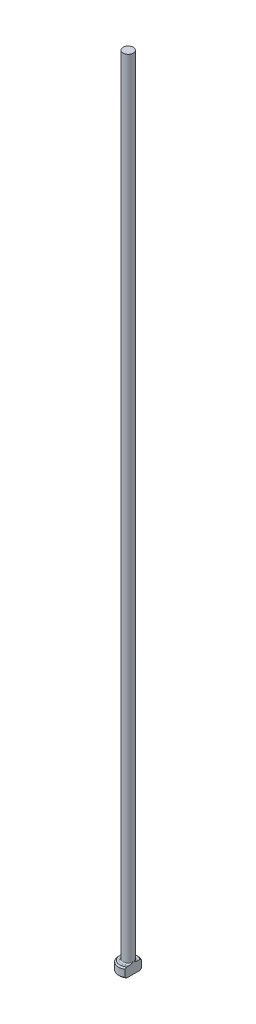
ISO-10303-21;
HEADER;
FILE_DESCRIPTION(('STEP AP214'),'2;1');
FILE_NAME('part.step','',(''),(''),'','','');
FILE_SCHEMA(('AUTOMOTIVE_DESIGN { 1 0 10303 214 1 1 1 1 }'));
ENDSEC;
DATA;
#1=APPLICATION_CONTEXT('core data for automotive mechanical design processes');
#2=APPLICATION_PROTOCOL_DEFINITION('international standard','automotive_design',2000,#1);
#3=PRODUCT_CONTEXT('',#1,'mechanical');
#4=PRODUCT('Part','Part','',(#3));
#5=PRODUCT_RELATED_PRODUCT_CATEGORY('part','',(#4));
#6=PRODUCT_DEFINITION_FORMATION('','',#4);
#7=PRODUCT_DEFINITION_CONTEXT('part definition',#1,'design');
#8=PRODUCT_DEFINITION('design','',#6,#7);
#9=PRODUCT_DEFINITION_SHAPE('','',#8);
#10=(LENGTH_UNIT() NAMED_UNIT(*) SI_UNIT(.MILLI.,.METRE.));
#11=(NAMED_UNIT(*) PLANE_ANGLE_UNIT() SI_UNIT($,.RADIAN.));
#12=(NAMED_UNIT(*) SI_UNIT($,.STERADIAN.) SOLID_ANGLE_UNIT());
#13=UNCERTAINTY_MEASURE_WITH_UNIT(LENGTH_MEASURE(1.E-05),#10,'distance_accuracy_value','');
#14=(GEOMETRIC_REPRESENTATION_CONTEXT(3) GLOBAL_UNCERTAINTY_ASSIGNED_CONTEXT((#13)) GLOBAL_UNIT_ASSIGNED_CONTEXT((#10,
#11,#12)) REPRESENTATION_CONTEXT('',''));
#15=CARTESIAN_POINT('',(0.,0.,0.));
#16=DIRECTION('',(0.,0.,1.));
#17=DIRECTION('',(1.,0.,0.));
#18=AXIS2_PLACEMENT_3D('',#15,#16,#17);
#19=CARTESIAN_POINT('',(0.,0.,0.));
#20=DIRECTION('',(0.,-1.,0.));
#21=DIRECTION('',(0.,0.,-1.));
#22=AXIS2_PLACEMENT_3D('',#19,#20,#21);
#23=PLANE('',#22);
#24=CARTESIAN_POINT('',(0.,0.,0.));
#25=DIRECTION('',(0.,-1.,0.));
#26=DIRECTION('',(0.,0.,-1.));
#27=AXIS2_PLACEMENT_3D('',#24,#25,#26);
#28=CIRCLE('',#27,1.29999999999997);
#29=CARTESIAN_POINT('',(0.799999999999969,0.,1.02469507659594));
#30=VERTEX_POINT('',#29);
#31=CARTESIAN_POINT('',(0.799999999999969,0.,-1.02469507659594));
#32=VERTEX_POINT('',#31);
#33=EDGE_CURVE('E98',#30,#32,#28,.T.);
#34=ORIENTED_EDGE('',*,*,#33,.T.);
#35=DIRECTION('',(0.,0.,1.));
#36=VECTOR('',#35,1.);
#37=CARTESIAN_POINT('',(0.799999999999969,0.,-1.26885775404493));
#38=LINE('',#37,#36);
#39=EDGE_CURVE('E83',#32,#30,#38,.T.);
#40=ORIENTED_EDGE('',*,*,#39,.T.);
#41=EDGE_LOOP('',(#34,#40));
#42=FACE_BOUND('',#41,.T.);
#43=ADVANCED_FACE('F32',(#42),#23,.T.);
#44=CARTESIAN_POINT('',(0.,259.958771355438,0.));
#45=DIRECTION('',(0.,1.,0.));
#46=DIRECTION('',(0.,0.,1.));
#47=AXIS2_PLACEMENT_3D('',#44,#45,#46);
#48=CYLINDRICAL_SURFACE('',#47,1.49999999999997);
#49=CARTESIAN_POINT('',(0.,1.29999999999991,0.));
#50=DIRECTION('',(0.,1.,0.));
#51=DIRECTION('',(0.,0.,1.));
#52=AXIS2_PLACEMENT_3D('',#49,#50,#51);
#53=CIRCLE('',#52,1.49999999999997);
#54=CARTESIAN_POINT('',(0.799999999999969,1.29999999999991,1.26885775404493));
#55=VERTEX_POINT('',#54);
#56=CARTESIAN_POINT('',(0.799999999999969,1.29999999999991,-1.26885775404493));
#57=VERTEX_POINT('',#56);
#58=EDGE_CURVE('E104',#55,#57,#53,.F.);
#59=ORIENTED_EDGE('',*,*,#58,.T.);
#60=DIRECTION('',(0.,-1.,0.));
#61=VECTOR('',#60,1.);
#62=CARTESIAN_POINT('',(0.799999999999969,125.,-1.26885775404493));
#63=LINE('',#62,#61);
#64=CARTESIAN_POINT('',(0.799999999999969,0.200000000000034,-1.26885775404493));
#65=VERTEX_POINT('',#64);
#66=EDGE_CURVE('E183',#57,#65,#63,.T.);
#67=ORIENTED_EDGE('',*,*,#66,.T.);
#68=CARTESIAN_POINT('',(0.,0.200000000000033,0.));
#69=DIRECTION('',(0.,-1.,0.));
#70=DIRECTION('',(0.,0.,-1.));
#71=AXIS2_PLACEMENT_3D('',#68,#69,#70);
#72=CIRCLE('',#71,1.49999999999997);
#73=CARTESIAN_POINT('',(0.799999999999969,0.200000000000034,1.26885775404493));
#74=VERTEX_POINT('',#73);
#75=EDGE_CURVE('E100',#65,#74,#72,.F.);
#76=ORIENTED_EDGE('',*,*,#75,.T.);
#77=DIRECTION('',(0.,-1.,0.));
#78=VECTOR('',#77,1.);
#79=CARTESIAN_POINT('',(0.799999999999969,125.,1.26885775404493));
#80=LINE('',#79,#78);
#81=EDGE_CURVE('E93',#55,#74,#80,.T.);
#82=ORIENTED_EDGE('',*,*,#81,.F.);
#83=EDGE_LOOP('',(#59,#67,#76,#82));
#84=FACE_BOUND('',#83,.T.);
#85=ADVANCED_FACE('F158',(#84),#48,.T.);
#86=CARTESIAN_POINT('',(-1.49999999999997,1.5,0.));
#87=DIRECTION('',(0.,1.,0.));
#88=DIRECTION('',(0.,0.,1.));
#89=AXIS2_PLACEMENT_3D('',#86,#87,#88);
#90=PLANE('',#89);
#91=CARTESIAN_POINT('',(0.,1.5,0.));
#92=DIRECTION('',(0.,1.,0.));
#93=DIRECTION('',(0.,0.,1.));
#94=AXIS2_PLACEMENT_3D('',#91,#92,#93);
#95=CIRCLE('',#94,1.29999999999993);
#96=CARTESIAN_POINT('',(0.799999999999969,1.5,-1.02469507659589));
#97=VERTEX_POINT('',#96);
#98=CARTESIAN_POINT('',(0.799999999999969,1.5,1.02469507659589));
#99=VERTEX_POINT('',#98);
#100=EDGE_CURVE('E178',#97,#99,#95,.T.);
#101=ORIENTED_EDGE('',*,*,#100,.T.);
#102=DIRECTION('',(0.,0.,-1.));
#103=VECTOR('',#102,1.);
#104=CARTESIAN_POINT('',(0.799999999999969,1.5,0.));
#105=LINE('',#104,#103);
#106=CARTESIAN_POINT('',(0.799999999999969,1.49999999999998,0.599999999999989));
#107=VERTEX_POINT('',#106);
#108=EDGE_CURVE('E57',#99,#107,#105,.T.);
#109=ORIENTED_EDGE('',*,*,#108,.T.);
#110=CARTESIAN_POINT('',(0.,1.5,0.));
#111=DIRECTION('',(0.,1.,0.));
#112=DIRECTION('',(0.,0.,1.));
#113=AXIS2_PLACEMENT_3D('',#110,#111,#112);
#114=CIRCLE('',#113,0.999999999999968);
#115=CARTESIAN_POINT('',(0.799999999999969,1.49999999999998,-0.600000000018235));
#116=VERTEX_POINT('',#115);
#117=EDGE_CURVE('E107',#107,#116,#114,.F.);
#118=ORIENTED_EDGE('',*,*,#117,.T.);
#119=EDGE_CURVE('E136',#116,#97,#105,.T.);
#120=ORIENTED_EDGE('',*,*,#119,.T.);
#121=EDGE_LOOP('',(#101,#109,#118,#120));
#122=FACE_BOUND('',#121,.T.);
#123=ADVANCED_FACE('F147',(#122),#90,.T.);
#124=CARTESIAN_POINT('',(0.,1.5,0.));
#125=DIRECTION('',(0.,-1.,0.));
#126=DIRECTION('',(0.,0.,-1.));
#127=AXIS2_PLACEMENT_3D('',#124,#125,#126);
#128=CONICAL_SURFACE('',#127,1.29999999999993,0.785398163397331);
#129=ORIENTED_EDGE('',*,*,#58,.F.);
#130=CARTESIAN_POINT('',(0.799999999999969,-0.108590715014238,2.79640840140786));
#131=CARTESIAN_POINT('',(0.799999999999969,-0.000882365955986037,2.68432462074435));
#132=CARTESIAN_POINT('',(0.799999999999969,0.106624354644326,2.57204275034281));
#133=CARTESIAN_POINT('',(0.799999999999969,0.320918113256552,2.34672914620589));
#134=CARTESIAN_POINT('',(0.799999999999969,0.427704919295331,2.23369719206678));
#135=CARTESIAN_POINT('',(0.799999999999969,0.639300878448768,2.00753337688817));
#136=CARTESIAN_POINT('',(0.799999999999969,0.744119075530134,1.89441000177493));
#137=CARTESIAN_POINT('',(0.799999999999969,0.951972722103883,1.66655886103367));
#138=CARTESIAN_POINT('',(0.799999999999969,1.05500843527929,1.55183133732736));
#139=CARTESIAN_POINT('',(0.799999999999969,1.2316116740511,1.34966755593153));
#140=CARTESIAN_POINT('',(0.799999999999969,1.30589617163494,1.26286366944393));
#141=CARTESIAN_POINT('',(0.799999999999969,1.41524859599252,1.13055151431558));
#142=CARTESIAN_POINT('',(0.799999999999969,1.45144464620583,1.08597829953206));
#143=CARTESIAN_POINT('',(0.799999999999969,1.52278909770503,0.996003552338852));
#144=CARTESIAN_POINT('',(0.799999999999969,1.55793758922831,0.950602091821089));
#145=CARTESIAN_POINT('',(0.799999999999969,1.6270756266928,0.858309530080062));
#146=CARTESIAN_POINT('',(0.799999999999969,1.66105269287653,0.811409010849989));
#147=CARTESIAN_POINT('',(0.799999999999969,1.7268909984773,0.71607032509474));
#148=CARTESIAN_POINT('',(0.799999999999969,1.75875040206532,0.667630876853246));
#149=CARTESIAN_POINT('',(0.799999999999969,1.81908230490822,0.568961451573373));
#150=CARTESIAN_POINT('',(0.799999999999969,1.84757011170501,0.518741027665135));
#151=CARTESIAN_POINT('',(0.799999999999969,1.89949059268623,0.415809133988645));
#152=CARTESIAN_POINT('',(0.799999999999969,1.92293317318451,0.363102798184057));
#153=CARTESIAN_POINT('',(0.799999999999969,1.96197481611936,0.254586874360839));
#154=CARTESIAN_POINT('',(0.799999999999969,1.97756580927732,0.198774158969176));
#155=CARTESIAN_POINT('',(0.799999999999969,1.99243400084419,0.113761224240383));
#156=CARTESIAN_POINT('',(0.799999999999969,1.99597240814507,0.0852975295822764));
#157=CARTESIAN_POINT('',(0.799999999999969,2.00001065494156,0.0281499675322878));
#158=CARTESIAN_POINT('',(0.799999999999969,2.00051084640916,-0.000533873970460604));
#159=CARTESIAN_POINT('',(0.799999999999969,1.99842510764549,-0.057827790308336));
#160=CARTESIAN_POINT('',(0.799999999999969,1.99583465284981,-0.0864376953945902));
#161=CARTESIAN_POINT('',(0.799999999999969,1.9877631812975,-0.143248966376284));
#162=CARTESIAN_POINT('',(0.799999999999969,1.98228105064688,-0.171450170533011));
#163=CARTESIAN_POINT('',(0.799999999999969,1.96874374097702,-0.227447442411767));
#164=CARTESIAN_POINT('',(0.799999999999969,1.96066903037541,-0.25523870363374));
#165=CARTESIAN_POINT('',(0.799999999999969,1.94239006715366,-0.310100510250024));
#166=CARTESIAN_POINT('',(0.799999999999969,1.93218575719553,-0.337171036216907));
#167=CARTESIAN_POINT('',(0.799999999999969,1.89406620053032,-0.429279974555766));
#168=CARTESIAN_POINT('',(0.799999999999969,1.86189848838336,-0.492545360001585));
#169=CARTESIAN_POINT('',(0.799999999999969,1.79172992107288,-0.615769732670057));
#170=CARTESIAN_POINT('',(0.799999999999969,1.75371426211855,-0.675719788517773));
#171=CARTESIAN_POINT('',(0.799999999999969,1.67379436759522,-0.793878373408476));
#172=CARTESIAN_POINT('',(0.799999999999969,1.63185308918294,-0.852061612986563));
#173=CARTESIAN_POINT('',(0.799999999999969,1.5458025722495,-0.96666105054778));
#174=CARTESIAN_POINT('',(0.799999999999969,1.50169617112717,-1.02307941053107));
#175=CARTESIAN_POINT('',(0.799999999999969,1.3942548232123,-1.15684265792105));
#176=CARTESIAN_POINT('',(0.799999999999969,1.33022313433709,-1.23362537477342));
#177=CARTESIAN_POINT('',(0.799999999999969,1.20042261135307,-1.38571338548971));
#178=CARTESIAN_POINT('',(0.799999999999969,1.1346535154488,-1.46101845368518));
#179=CARTESIAN_POINT('',(0.799999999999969,1.00190865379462,-1.61069142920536));
#180=CARTESIAN_POINT('',(0.799999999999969,0.934931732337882,-1.68505830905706));
#181=CARTESIAN_POINT('',(0.799999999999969,0.80019143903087,-1.83307655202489));
#182=CARTESIAN_POINT('',(0.799999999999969,0.7324280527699,-1.90672790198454));
#183=CARTESIAN_POINT('',(0.799999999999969,0.60062820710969,-2.0488772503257));
#184=CARTESIAN_POINT('',(0.799999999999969,0.536626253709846,-2.11740728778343));
#185=CARTESIAN_POINT('',(0.799999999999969,0.408245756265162,-2.25411608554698));
#186=CARTESIAN_POINT('',(0.799999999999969,0.343867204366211,-2.32229483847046));
#187=CARTESIAN_POINT('',(0.799999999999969,0.214937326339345,-2.45825447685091));
#188=CARTESIAN_POINT('',(0.799999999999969,0.150386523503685,-2.52603585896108));
#189=CARTESIAN_POINT('',(0.799999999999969,0.0210558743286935,-2.66137559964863));
#190=CARTESIAN_POINT('',(0.799999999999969,-0.0437239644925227,-2.72893396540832));
#191=CARTESIAN_POINT('',(0.799999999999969,-0.108590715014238,-2.79640840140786));
#192=B_SPLINE_CURVE_WITH_KNOTS('',3,(#130,#131,#132,#133,#134,#135,#136,#137,#138,#139,#140,
#141,#142,#143,#144,#145,#146,#147,#148,#149,#150,#151,#152,#153,#154,#155,#156,#157,#158,#159,
#160,#161,#162,#163,#164,#165,#166,#167,#168,#169,#170,#171,#172,#173,#174,#175,#176,#177,#178,
#179,#180,#181,#182,#183,#184,#185,#186,#187,#188,#189,#190,#191),.UNSPECIFIED.,.F.,.F.,(4,2,2,
2,2,2,2,2,2,2,2,2,2,2,2,2,2,2,2,2,2,2,2,2,2,2,2,2,2,2,4),(0.,0.466346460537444,
0.932836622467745,1.39548573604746,1.85806581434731,2.20076900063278,2.37301446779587,
2.54524505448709,2.71894834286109,2.89280030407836,3.06582993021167,3.23851664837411,
3.41138048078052,3.49728508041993,3.58317972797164,3.66920027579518,3.75525398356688,
3.84197183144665,3.92869201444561,4.14096510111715,4.35378466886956,4.56886671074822,
4.78367404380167,5.08356111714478,5.38349363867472,5.68373022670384,5.98397232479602,
6.26527738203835,6.54658832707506,6.82739033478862,7.10818320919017),.UNSPECIFIED.);
#193=EDGE_CURVE('E135',#55,#99,#192,.T.);
#194=ORIENTED_EDGE('',*,*,#193,.T.);
#195=ORIENTED_EDGE('',*,*,#100,.F.);
#196=EDGE_CURVE('E127',#97,#57,#192,.T.);
#197=ORIENTED_EDGE('',*,*,#196,.T.);
#198=EDGE_LOOP('',(#129,#194,#195,#197));
#199=FACE_BOUND('',#198,.T.);
#200=ADVANCED_FACE('F143',(#199),#128,.T.);
#201=CARTESIAN_POINT('',(0.,0.200000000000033,0.));
#202=DIRECTION('',(0.,1.,0.));
#203=DIRECTION('',(0.,0.,1.));
#204=AXIS2_PLACEMENT_3D('',#201,#202,#203);
#205=CONICAL_SURFACE('',#204,1.49999999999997,0.785398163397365);
#206=ORIENTED_EDGE('',*,*,#75,.F.);
#207=CARTESIAN_POINT('',(0.799999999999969,1.60859071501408,-2.79640840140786));
#208=CARTESIAN_POINT('',(0.799999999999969,1.50088236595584,-2.68432462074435));
#209=CARTESIAN_POINT('',(0.799999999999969,1.39337564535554,-2.57204275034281));
#210=CARTESIAN_POINT('',(0.799999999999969,1.17908188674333,-2.3467291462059));
#211=CARTESIAN_POINT('',(0.799999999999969,1.07229508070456,-2.23369719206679));
#212=CARTESIAN_POINT('',(0.799999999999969,0.860699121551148,-2.00753337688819));
#213=CARTESIAN_POINT('',(0.799999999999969,0.755880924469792,-1.89441000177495));
#214=CARTESIAN_POINT('',(0.799999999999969,0.548027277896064,-1.6665588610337));
#215=CARTESIAN_POINT('',(0.799999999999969,0.444991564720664,-1.55183133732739));
#216=CARTESIAN_POINT('',(0.799999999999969,0.268388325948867,-1.34966755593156));
#217=CARTESIAN_POINT('',(0.799999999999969,0.194103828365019,-1.26286366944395));
#218=CARTESIAN_POINT('',(0.799999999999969,0.0847514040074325,-1.13055151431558));
#219=CARTESIAN_POINT('',(0.799999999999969,0.0485553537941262,-1.08597829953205));
#220=CARTESIAN_POINT('',(0.799999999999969,-0.022789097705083,-0.996003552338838));
#221=CARTESIAN_POINT('',(0.799999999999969,-0.0579375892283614,-0.950602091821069));
#222=CARTESIAN_POINT('',(0.799999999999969,-0.127075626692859,-0.858309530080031));
#223=CARTESIAN_POINT('',(0.799999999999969,-0.161052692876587,-0.811409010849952));
#224=CARTESIAN_POINT('',(0.799999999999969,-0.226890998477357,-0.71607032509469));
#225=CARTESIAN_POINT('',(0.799999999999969,-0.258750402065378,-0.667630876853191));
#226=CARTESIAN_POINT('',(0.799999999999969,-0.319082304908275,-0.568961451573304));
#227=CARTESIAN_POINT('',(0.799999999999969,-0.347570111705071,-0.51874102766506));
#228=CARTESIAN_POINT('',(0.799999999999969,-0.39949059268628,-0.415809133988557));
#229=CARTESIAN_POINT('',(0.799999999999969,-0.422933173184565,-0.363102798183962));
#230=CARTESIAN_POINT('',(0.799999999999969,-0.461974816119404,-0.254586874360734));
#231=CARTESIAN_POINT('',(0.799999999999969,-0.477565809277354,-0.19877415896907));
#232=CARTESIAN_POINT('',(0.799999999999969,-0.492434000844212,-0.113761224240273));
#233=CARTESIAN_POINT('',(0.799999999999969,-0.495972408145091,-0.085297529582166));
#234=CARTESIAN_POINT('',(0.799999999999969,-0.500010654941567,-0.0281499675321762));
#235=CARTESIAN_POINT('',(0.799999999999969,-0.500510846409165,0.000533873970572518));
#236=CARTESIAN_POINT('',(0.799999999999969,-0.49842510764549,0.0578277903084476));
#237=CARTESIAN_POINT('',(0.799999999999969,-0.495834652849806,0.0864376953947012));
#238=CARTESIAN_POINT('',(0.799999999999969,-0.487763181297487,0.143248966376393));
#239=CARTESIAN_POINT('',(0.799999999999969,-0.482281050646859,0.17145017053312));
#240=CARTESIAN_POINT('',(0.799999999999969,-0.468743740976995,0.227447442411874));
#241=CARTESIAN_POINT('',(0.799999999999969,-0.460669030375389,0.255238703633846));
#242=CARTESIAN_POINT('',(0.799999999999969,-0.442390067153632,0.310100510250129));
#243=CARTESIAN_POINT('',(0.799999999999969,-0.432185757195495,0.33717103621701));
#244=CARTESIAN_POINT('',(0.799999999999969,-0.394066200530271,0.429279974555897));
#245=CARTESIAN_POINT('',(0.799999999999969,-0.361898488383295,0.492545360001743));
#246=CARTESIAN_POINT('',(0.799999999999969,-0.291729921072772,0.615769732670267));
#247=CARTESIAN_POINT('',(0.799999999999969,-0.253714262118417,0.675719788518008));
#248=CARTESIAN_POINT('',(0.799999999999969,-0.173794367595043,0.793878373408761));
#249=CARTESIAN_POINT('',(0.799999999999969,-0.131853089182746,0.852061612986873));
#250=CARTESIAN_POINT('',(0.799999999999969,-0.0458025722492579,0.966661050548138));
#251=CARTESIAN_POINT('',(0.799999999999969,-0.00169617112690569,1.02307941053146));
#252=CARTESIAN_POINT('',(0.799999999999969,0.105745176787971,1.15684265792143));
#253=CARTESIAN_POINT('',(0.799999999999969,0.169776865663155,1.23362537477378));
#254=CARTESIAN_POINT('',(0.799999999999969,0.299577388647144,1.38571338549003));
#255=CARTESIAN_POINT('',(0.799999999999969,0.365346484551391,1.46101845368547));
#256=CARTESIAN_POINT('',(0.799999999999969,0.498091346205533,1.61069142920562));
#257=CARTESIAN_POINT('',(0.799999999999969,0.56506826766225,1.68505830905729));
#258=CARTESIAN_POINT('',(0.799999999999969,0.699808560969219,1.83307655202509));
#259=CARTESIAN_POINT('',(0.799999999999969,0.767571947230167,1.90672790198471));
#260=CARTESIAN_POINT('',(0.799999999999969,0.899371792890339,2.04887725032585));
#261=CARTESIAN_POINT('',(0.799999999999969,0.963373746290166,2.11740728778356));
#262=CARTESIAN_POINT('',(0.799999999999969,1.09175424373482,2.25411608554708));
#263=CARTESIAN_POINT('',(0.799999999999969,1.15613279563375,2.32229483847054));
#264=CARTESIAN_POINT('',(0.799999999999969,1.28506267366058,2.45825447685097));
#265=CARTESIAN_POINT('',(0.799999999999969,1.34961347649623,2.52603585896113));
#266=CARTESIAN_POINT('',(0.799999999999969,1.47894412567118,2.66137559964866));
#267=CARTESIAN_POINT('',(0.799999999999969,1.54372396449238,2.72893396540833));
#268=CARTESIAN_POINT('',(0.799999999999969,1.60859071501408,2.79640840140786));
#269=B_SPLINE_CURVE_WITH_KNOTS('',3,(#207,#208,#209,#210,#211,#212,#213,#214,#215,#216,#217,
#218,#219,#220,#221,#222,#223,#224,#225,#226,#227,#228,#229,#230,#231,#232,#233,#234,#235,#236,
#237,#238,#239,#240,#241,#242,#243,#244,#245,#246,#247,#248,#249,#250,#251,#252,#253,#254,#255,
#256,#257,#258,#259,#260,#261,#262,#263,#264,#265,#266,#267,#268),.UNSPECIFIED.,.F.,.F.,(4,2,2,
2,2,2,2,2,2,2,2,2,2,2,2,2,2,2,2,2,2,2,2,2,2,2,2,2,2,2,4),(0.,0.466346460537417,
0.932836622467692,1.39548573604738,1.8580658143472,2.2007690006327,2.3730144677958,
2.54524505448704,2.71894834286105,2.89280030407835,3.06582993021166,3.23851664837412,
3.41138048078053,3.49728508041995,3.58317972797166,3.6692002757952,3.75525398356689,
3.84197183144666,3.92869201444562,4.14096510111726,4.35378466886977,4.56886671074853,
4.78367404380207,5.0835611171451,5.38349363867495,5.68373022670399,5.98397232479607,
6.26527738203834,6.54658832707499,6.82739033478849,7.10818320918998),.UNSPECIFIED.);
#270=EDGE_CURVE('E86',#65,#32,#269,.T.);
#271=ORIENTED_EDGE('',*,*,#270,.T.);
#272=ORIENTED_EDGE('',*,*,#33,.F.);
#273=EDGE_CURVE('E89',#30,#74,#269,.T.);
#274=ORIENTED_EDGE('',*,*,#273,.T.);
#275=EDGE_LOOP('',(#206,#271,#272,#274));
#276=FACE_BOUND('',#275,.T.);
#277=ADVANCED_FACE('F97',(#276),#205,.T.);
#278=CARTESIAN_POINT('',(0.,1.69999999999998,0.));
#279=DIRECTION('',(0.,1.,0.));
#280=DIRECTION('',(0.,0.,1.));
#281=AXIS2_PLACEMENT_3D('',#278,#279,#280);
#282=TOROIDAL_SURFACE('',#281,0.999999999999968,0.2);
#283=CARTESIAN_POINT('',(0.799999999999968,1.69999999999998,0.));
#284=CARTESIAN_POINT('',(0.799999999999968,1.70000052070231,-1.07740569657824E-10));
#285=CARTESIAN_POINT('',(0.799999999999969,1.70000104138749,-8.25850860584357E-08));
#286=CARTESIAN_POINT('',(0.799999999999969,1.7000020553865,-3.57496578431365E-07));
#287=CARTESIAN_POINT('',(0.799999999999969,1.7000025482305,-5.51414205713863E-07));
#288=CARTESIAN_POINT('',(0.799999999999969,1.70000352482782,-1.02256682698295E-06));
#289=CARTESIAN_POINT('',(0.799999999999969,1.70000400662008,-1.30376835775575E-06));
#290=CARTESIAN_POINT('',(0.799999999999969,1.7000049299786,-1.92036681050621E-06));
#291=CARTESIAN_POINT('',(0.799999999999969,1.70000537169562,-2.25554622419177E-06));
#292=CARTESIAN_POINT('',(0.799999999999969,1.70000679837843,-3.42582461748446E-06));
#293=CARTESIAN_POINT('',(0.799999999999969,1.7000077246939,-4.33303061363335E-06));
#294=CARTESIAN_POINT('',(0.799999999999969,1.70000942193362,-6.24182407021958E-06));
#295=CARTESIAN_POINT('',(0.799999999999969,1.70001019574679,-7.24099037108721E-06));
#296=CARTESIAN_POINT('',(0.799999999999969,1.70001296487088,-1.10006264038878E-05));
#297=CARTESIAN_POINT('',(0.799999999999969,1.70001480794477,-1.38764659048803E-05));
#298=CARTESIAN_POINT('',(0.799999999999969,1.70001794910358,-1.96579256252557E-05));
#299=CARTESIAN_POINT('',(0.799999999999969,1.70001927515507,-2.25490182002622E-05));
#300=CARTESIAN_POINT('',(0.799999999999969,1.70002465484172,-3.44465536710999E-05));
#301=CARTESIAN_POINT('',(0.799999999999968,1.70002857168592,-4.35098174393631E-05));
#302=CARTESIAN_POINT('',(0.799999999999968,1.70003510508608,-6.07223717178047E-05));
#303=CARTESIAN_POINT('',(0.799999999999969,1.70003782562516,-6.88309361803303E-05));
#304=CARTESIAN_POINT('',(0.799999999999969,1.70005864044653,-0.000125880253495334));
#305=CARTESIAN_POINT('',(0.799999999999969,1.70008424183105,-0.000171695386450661));
#306=CARTESIAN_POINT('',(0.799999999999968,1.70017855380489,-0.00034720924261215));
#307=CARTESIAN_POINT('',(0.799999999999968,1.70024169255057,-0.000479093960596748));
#308=CARTESIAN_POINT('',(0.799999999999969,1.70048616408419,-0.000981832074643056));
#309=CARTESIAN_POINT('',(0.799999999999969,1.70067331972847,-0.00135043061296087));
#310=CARTESIAN_POINT('',(0.799999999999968,1.70142117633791,-0.00283094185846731));
#311=CARTESIAN_POINT('',(0.799999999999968,1.70197535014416,-0.00394535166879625));
#312=CARTESIAN_POINT('',(0.799999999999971,1.71061058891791,-0.0213011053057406));
#313=CARTESIAN_POINT('',(0.799999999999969,1.71874400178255,-0.0375230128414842));
#314=CARTESIAN_POINT('',(0.799999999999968,1.73460832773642,-0.0694811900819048));
#315=CARTESIAN_POINT('',(0.799999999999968,1.74234357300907,-0.0852154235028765));
#316=CARTESIAN_POINT('',(0.799999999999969,1.75846316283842,-0.118454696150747));
#317=CARTESIAN_POINT('',(0.799999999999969,1.7668284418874,-0.135969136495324));
#318=CARTESIAN_POINT('',(0.799999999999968,1.78329738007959,-0.171319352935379));
#319=CARTESIAN_POINT('',(0.799999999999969,1.79139788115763,-0.189156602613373));
#320=CARTESIAN_POINT('',(0.799999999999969,1.81123303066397,-0.234404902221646));
#321=CARTESIAN_POINT('',(0.799999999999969,1.82265785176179,-0.261953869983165));
#322=CARTESIAN_POINT('',(0.799999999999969,1.84367616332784,-0.31710366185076));
#323=CARTESIAN_POINT('',(0.799999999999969,1.85330270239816,-0.344691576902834));
#324=CARTESIAN_POINT('',(0.799999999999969,1.86619221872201,-0.38675392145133));
#325=CARTESIAN_POINT('',(0.799999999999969,1.87025173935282,-0.400983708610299));
#326=CARTESIAN_POINT('',(0.799999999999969,1.87774404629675,-0.429670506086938));
#327=CARTESIAN_POINT('',(0.799999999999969,1.8811740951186,-0.44412822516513));
#328=CARTESIAN_POINT('',(0.799999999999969,1.89063941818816,-0.489163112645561));
#329=CARTESIAN_POINT('',(0.799999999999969,1.89540671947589,-0.520030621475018));
#330=CARTESIAN_POINT('',(0.799999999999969,1.90049267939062,-0.58212622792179));
#331=CARTESIAN_POINT('',(0.799999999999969,1.90081735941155,-0.613353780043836));
#332=CARTESIAN_POINT('',(0.799999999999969,1.89549709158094,-0.674915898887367));
#333=CARTESIAN_POINT('',(0.799999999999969,1.88995916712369,-0.705256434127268));
#334=CARTESIAN_POINT('',(0.799999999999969,1.8763682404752,-0.747474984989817));
#335=CARTESIAN_POINT('',(0.799999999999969,1.8713676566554,-0.760339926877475));
#336=CARTESIAN_POINT('',(0.799999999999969,1.85959942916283,-0.785299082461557));
#337=CARTESIAN_POINT('',(0.799999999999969,1.85282697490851,-0.79739108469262));
#338=CARTESIAN_POINT('',(0.799999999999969,1.83727733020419,-0.820446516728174));
#339=CARTESIAN_POINT('',(0.799999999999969,1.82847700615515,-0.831394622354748));
#340=CARTESIAN_POINT('',(0.799999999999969,1.80887943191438,-0.851318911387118));
#341=CARTESIAN_POINT('',(0.799999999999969,1.79808937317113,-0.860301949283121));
#342=CARTESIAN_POINT('',(0.799999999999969,1.77879935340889,-0.872872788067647));
#343=CARTESIAN_POINT('',(0.799999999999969,1.77081074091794,-0.877249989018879));
#344=CARTESIAN_POINT('',(0.799999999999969,1.75421627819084,-0.884624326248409));
#345=CARTESIAN_POINT('',(0.799999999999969,1.74561080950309,-0.887622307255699));
#346=CARTESIAN_POINT('',(0.799999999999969,1.72796171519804,-0.892065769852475));
#347=CARTESIAN_POINT('',(0.799999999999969,1.7189162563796,-0.893504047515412));
#348=CARTESIAN_POINT('',(0.799999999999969,1.70071433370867,-0.894703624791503));
#349=CARTESIAN_POINT('',(0.799999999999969,1.69155789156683,-0.894465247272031));
#350=CARTESIAN_POINT('',(0.799999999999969,1.67411305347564,-0.892409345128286));
#351=CARTESIAN_POINT('',(0.799999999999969,1.66581040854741,-0.890709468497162));
#352=CARTESIAN_POINT('',(0.799999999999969,1.64959326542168,-0.885987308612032));
#353=CARTESIAN_POINT('',(0.799999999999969,1.64167879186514,-0.882964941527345));
#354=CARTESIAN_POINT('',(0.799999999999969,1.62612521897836,-0.875619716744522));
#355=CARTESIAN_POINT('',(0.799999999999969,1.6185069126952,-0.871253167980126));
#356=CARTESIAN_POINT('',(0.799999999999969,1.60398538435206,-0.861466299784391));
#357=CARTESIAN_POINT('',(0.799999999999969,1.59708247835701,-0.856045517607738));
#358=CARTESIAN_POINT('',(0.799999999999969,1.58115991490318,-0.841751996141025));
#359=CARTESIAN_POINT('',(0.799999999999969,1.57255696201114,-0.832413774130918));
#360=CARTESIAN_POINT('',(0.799999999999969,1.5569709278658,-0.812463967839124));
#361=CARTESIAN_POINT('',(0.799999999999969,1.54999208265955,-0.80184916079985));
#362=CARTESIAN_POINT('',(0.799999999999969,1.53507995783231,-0.775315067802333));
#363=CARTESIAN_POINT('',(0.799999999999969,1.52789105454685,-0.758978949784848));
#364=CARTESIAN_POINT('',(0.799999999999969,1.51619194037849,-0.72544267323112));
#365=CARTESIAN_POINT('',(0.799999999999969,1.51167841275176,-0.708243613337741));
#366=CARTESIAN_POINT('',(0.799999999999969,1.50308125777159,-0.664008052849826));
#367=CARTESIAN_POINT('',(0.799999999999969,1.50054575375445,-0.636674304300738));
#368=CARTESIAN_POINT('',(0.799999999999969,1.49960545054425,-0.581571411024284));
#369=CARTESIAN_POINT('',(0.799999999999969,1.50126887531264,-0.553802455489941));
#370=CARTESIAN_POINT('',(0.799999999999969,1.51076969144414,-0.474087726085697));
#371=CARTESIAN_POINT('',(0.799999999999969,1.52278886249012,-0.422656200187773));
#372=CARTESIAN_POINT('',(0.799999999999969,1.54542054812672,-0.348884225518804));
#373=CARTESIAN_POINT('',(0.799999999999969,1.553391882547,-0.325596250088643));
#374=CARTESIAN_POINT('',(0.799999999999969,1.57044260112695,-0.279605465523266));
#375=CARTESIAN_POINT('',(0.799999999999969,1.5795136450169,-0.256899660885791));
#376=CARTESIAN_POINT('',(0.799999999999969,1.59612615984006,-0.217481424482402));
#377=CARTESIAN_POINT('',(0.799999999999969,1.60348346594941,-0.200689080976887));
#378=CARTESIAN_POINT('',(0.799999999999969,1.61873273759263,-0.16689025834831));
#379=CARTESIAN_POINT('',(0.799999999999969,1.62663303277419,-0.1498875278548));
#380=CARTESIAN_POINT('',(0.799999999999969,1.64000428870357,-0.12169659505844));
#381=CARTESIAN_POINT('',(0.799999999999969,1.64540046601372,-0.110472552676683));
#382=CARTESIAN_POINT('',(0.799999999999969,1.65623294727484,-0.088168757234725));
#383=CARTESIAN_POINT('',(0.799999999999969,1.66166844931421,-0.0770886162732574));
#384=CARTESIAN_POINT('',(0.799999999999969,1.67206713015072,-0.0560154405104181));
#385=CARTESIAN_POINT('',(0.799999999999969,1.67702562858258,-0.0460200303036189));
#386=CARTESIAN_POINT('',(0.799999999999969,1.68715625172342,-0.0257066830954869));
#387=CARTESIAN_POINT('',(0.799999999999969,1.69232987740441,-0.0153894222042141));
#388=CARTESIAN_POINT('',(0.799999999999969,1.69802413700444,-0.00394656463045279));
#389=CARTESIAN_POINT('',(0.799999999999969,1.69857766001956,-0.00283331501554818));
#390=CARTESIAN_POINT('',(0.799999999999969,1.69932534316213,-0.00135310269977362));
#391=CARTESIAN_POINT('',(0.799999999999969,1.69951294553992,-0.000983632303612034));
#392=CARTESIAN_POINT('',(0.799999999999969,1.69975796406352,-0.000479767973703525));
#393=CARTESIAN_POINT('',(0.799999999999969,1.69982122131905,-0.000347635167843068));
#394=CARTESIAN_POINT('',(0.799999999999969,1.69991569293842,-0.000171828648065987));
#395=CARTESIAN_POINT('',(0.799999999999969,1.69994132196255,-0.000125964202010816));
#396=CARTESIAN_POINT('',(0.799999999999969,1.69996215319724,-6.88565605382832E-05));
#397=CARTESIAN_POINT('',(0.799999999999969,1.69996487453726,-6.07436450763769E-05));
#398=CARTESIAN_POINT('',(0.799999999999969,1.69997141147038,-4.35218238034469E-05));
#399=CARTESIAN_POINT('',(0.799999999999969,1.69997533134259,-3.44537566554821E-05));
#400=CARTESIAN_POINT('',(0.799999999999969,1.69998071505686,-2.25508109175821E-05));
#401=CARTESIAN_POINT('',(0.799999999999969,1.69998204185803,-1.96589688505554E-05));
#402=CARTESIAN_POINT('',(0.799999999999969,1.69998518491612,-1.38761465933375E-05));
#403=CARTESIAN_POINT('',(0.799999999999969,1.69998702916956,-1.09997147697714E-05));
#404=CARTESIAN_POINT('',(0.799999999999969,1.6999897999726,-7.23954686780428E-06));
#405=CARTESIAN_POINT('',(0.799999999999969,1.6999905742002,-6.24031831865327E-06));
#406=CARTESIAN_POINT('',(0.799999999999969,1.69999227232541,-4.33148565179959E-06));
#407=CARTESIAN_POINT('',(0.799999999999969,1.69999319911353,-3.4243052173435E-06));
#408=CARTESIAN_POINT('',(0.799999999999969,1.69999462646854,-2.25416419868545E-06));
#409=CARTESIAN_POINT('',(0.799999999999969,1.69999506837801,-1.9190446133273E-06));
#410=CARTESIAN_POINT('',(0.799999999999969,1.69999599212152,-1.30259970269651E-06));
#411=CARTESIAN_POINT('',(0.799999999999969,1.69999647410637,-1.02149208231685E-06));
#412=CARTESIAN_POINT('',(0.799999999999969,1.69999745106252,-5.50567949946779E-07));
#413=CARTESIAN_POINT('',(0.799999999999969,1.69999794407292,-3.56781844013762E-07));
#414=CARTESIAN_POINT('',(0.799999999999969,1.69999895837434,-8.21863285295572E-08));
#415=CARTESIAN_POINT('',(0.799999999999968,1.69999947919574,1.07761657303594E-10));
#416=CARTESIAN_POINT('',(0.799999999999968,1.69999999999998,0.));
#417=B_SPLINE_CURVE_WITH_KNOTS('',3,(#283,#284,#285,#286,#287,#288,#289,#290,#291,#292,#293,
#294,#295,#296,#297,#298,#299,#300,#301,#302,#303,#304,#305,#306,#307,#308,#309,#310,#311,#312,
#313,#314,#315,#316,#317,#318,#319,#320,#321,#322,#323,#324,#325,#326,#327,#328,#329,#330,#331,
#332,#333,#334,#335,#336,#337,#338,#339,#340,#341,#342,#343,#344,#345,#346,#347,#348,#349,#350,
#351,#352,#353,#354,#355,#356,#357,#358,#359,#360,#361,#362,#363,#364,#365,#366,#367,#368,#369,
#370,#371,#372,#373,#374,#375,#376,#377,#378,#379,#380,#381,#382,#383,#384,#385,#386,#387,#388,
#389,#390,#391,#392,#393,#394,#395,#396,#397,#398,#399,#400,#401,#402,#403,#404,#405,#406,#407,
#408,#409,#410,#411,#412,#413,#414,#415,#416),.UNSPECIFIED.,.T.,.F.,(4,2,2,2,2,2,2,2,2,2,2,2,2,
2,2,2,2,2,2,2,2,2,2,2,2,2,2,2,2,2,2,2,2,2,2,2,2,2,2,2,2,2,2,2,2,2,2,2,2,2,2,2,2,2,2,2,2,2,2,2,2,
2,2,2,2,2,4),(0.,1.56041509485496E-06,3.14209997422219E-06,4.81003054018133E-06,
6.4714008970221E-06,1.03419149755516E-05,1.41300090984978E-05,2.43375473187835E-05,
3.38705168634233E-05,6.34790223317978E-05,8.91110433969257E-05,0.0002457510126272,
0.000685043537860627,0.00192443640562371,0.00565901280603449,0.0600913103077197,
0.112691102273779,0.170916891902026,0.229684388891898,0.319123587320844,0.406709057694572,
0.451087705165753,0.495654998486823,0.589095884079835,0.682410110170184,0.774049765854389,
0.815352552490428,0.856768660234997,0.898682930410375,0.940448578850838,0.967667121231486,
0.994868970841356,1.02219593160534,1.04951763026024,1.07482622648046,1.10013642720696,
1.12637630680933,1.15262773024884,1.19050680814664,1.22848360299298,1.28172910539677,
1.33490845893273,1.41680298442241,1.50003666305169,1.65746622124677,1.73131208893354,
1.80462934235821,1.85962660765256,1.91586794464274,1.95322923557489,1.990253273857,
2.02372755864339,2.05834809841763,2.06207870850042,2.06332103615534,2.06376115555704,
2.06391796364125,2.06394360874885,2.06397323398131,2.06398276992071,2.06399298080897,
2.06399676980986,2.06400064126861,2.06400230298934,2.06400397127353,2.0640055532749,
2.06400711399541),.UNSPECIFIED.);
#418=CARTESIAN_POINT('',(0.799999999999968,1.69999999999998,0.));
#419=VERTEX_POINT('',#418);
#420=EDGE_CURVE('E11',#116,#419,#417,.T.);
#421=ORIENTED_EDGE('',*,*,#420,.F.);
#422=ORIENTED_EDGE('',*,*,#117,.F.);
#423=CARTESIAN_POINT('',(0.799999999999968,1.69999999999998,0.));
#424=CARTESIAN_POINT('',(0.799999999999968,1.69999947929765,1.07740575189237E-10));
#425=CARTESIAN_POINT('',(0.799999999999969,1.69999895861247,8.25850860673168E-08));
#426=CARTESIAN_POINT('',(0.799999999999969,1.69999794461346,3.5749657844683E-07));
#427=CARTESIAN_POINT('',(0.799999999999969,1.69999745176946,5.51414205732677E-07));
#428=CARTESIAN_POINT('',(0.799999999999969,1.69999647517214,1.02256682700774E-06));
#429=CARTESIAN_POINT('',(0.799999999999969,1.69999599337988,1.30376835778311E-06));
#430=CARTESIAN_POINT('',(0.799999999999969,1.69999507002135,1.9203668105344E-06));
#431=CARTESIAN_POINT('',(0.799999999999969,1.69999462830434,2.25554622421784E-06));
#432=CARTESIAN_POINT('',(0.799999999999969,1.69999320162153,3.42582461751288E-06));
#433=CARTESIAN_POINT('',(0.799999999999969,1.69999227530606,4.33303061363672E-06));
#434=CARTESIAN_POINT('',(0.799999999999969,1.69999057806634,6.2418240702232E-06));
#435=CARTESIAN_POINT('',(0.799999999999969,1.69998980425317,7.24099037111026E-06));
#436=CARTESIAN_POINT('',(0.799999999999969,1.69998703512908,1.10006264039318E-05));
#437=CARTESIAN_POINT('',(0.799999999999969,1.69998519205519,1.38764659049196E-05));
#438=CARTESIAN_POINT('',(0.799999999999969,1.69998205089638,1.96579256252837E-05));
#439=CARTESIAN_POINT('',(0.799999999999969,1.69998072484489,2.25490182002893E-05));
#440=CARTESIAN_POINT('',(0.799999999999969,1.69997534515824,3.44465536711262E-05));
#441=CARTESIAN_POINT('',(0.799999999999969,1.69997142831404,4.35098174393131E-05));
#442=CARTESIAN_POINT('',(0.799999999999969,1.69996489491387,6.07223717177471E-05));
#443=CARTESIAN_POINT('',(0.799999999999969,1.6999621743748,6.88309361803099E-05));
#444=CARTESIAN_POINT('',(0.799999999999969,1.69994135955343,0.000125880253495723));
#445=CARTESIAN_POINT('',(0.799999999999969,1.69991575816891,0.000171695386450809));
#446=CARTESIAN_POINT('',(0.799999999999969,1.69982144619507,0.00034720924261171));
#447=CARTESIAN_POINT('',(0.799999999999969,1.69975830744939,0.000479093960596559));
#448=CARTESIAN_POINT('',(0.799999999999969,1.69951383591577,0.000981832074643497));
#449=CARTESIAN_POINT('',(0.799999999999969,1.69932668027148,0.00135043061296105));
#450=CARTESIAN_POINT('',(0.799999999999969,1.69857882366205,0.00283094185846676));
#451=CARTESIAN_POINT('',(0.799999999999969,1.6980246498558,0.00394535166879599));
#452=CARTESIAN_POINT('',(0.799999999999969,1.68938941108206,0.0213011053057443));
#453=CARTESIAN_POINT('',(0.799999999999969,1.68125599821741,0.0375230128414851));
#454=CARTESIAN_POINT('',(0.799999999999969,1.66539167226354,0.0694811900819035));
#455=CARTESIAN_POINT('',(0.799999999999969,1.65765642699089,0.0852154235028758));
#456=CARTESIAN_POINT('',(0.799999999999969,1.64153683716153,0.118454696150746));
#457=CARTESIAN_POINT('',(0.799999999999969,1.63317155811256,0.135969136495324));
#458=CARTESIAN_POINT('',(0.799999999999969,1.61670261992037,0.171319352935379));
#459=CARTESIAN_POINT('',(0.799999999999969,1.60860211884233,0.189156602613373));
#460=CARTESIAN_POINT('',(0.799999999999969,1.58876696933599,0.234404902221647));
#461=CARTESIAN_POINT('',(0.799999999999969,1.57734214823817,0.261953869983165));
#462=CARTESIAN_POINT('',(0.799999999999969,1.55632383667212,0.31710366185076));
#463=CARTESIAN_POINT('',(0.799999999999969,1.5466972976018,0.344691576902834));
#464=CARTESIAN_POINT('',(0.799999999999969,1.53380778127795,0.38675392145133));
#465=CARTESIAN_POINT('',(0.799999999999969,1.52974826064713,0.400983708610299));
#466=CARTESIAN_POINT('',(0.799999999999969,1.52225595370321,0.429670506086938));
#467=CARTESIAN_POINT('',(0.799999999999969,1.51882590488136,0.44412822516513));
#468=CARTESIAN_POINT('',(0.799999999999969,1.5093605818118,0.489163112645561));
#469=CARTESIAN_POINT('',(0.799999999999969,1.50459328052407,0.520030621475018));
#470=CARTESIAN_POINT('',(0.799999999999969,1.49950732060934,0.58212622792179));
#471=CARTESIAN_POINT('',(0.799999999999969,1.49918264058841,0.613353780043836));
#472=CARTESIAN_POINT('',(0.799999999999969,1.50450290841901,0.674915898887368));
#473=CARTESIAN_POINT('',(0.799999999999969,1.51004083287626,0.705256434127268));
#474=CARTESIAN_POINT('',(0.799999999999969,1.52363175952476,0.747474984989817));
#475=CARTESIAN_POINT('',(0.799999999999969,1.52863234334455,0.760339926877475));
#476=CARTESIAN_POINT('',(0.799999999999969,1.54040057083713,0.785299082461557));
#477=CARTESIAN_POINT('',(0.799999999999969,1.54717302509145,0.79739108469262));
#478=CARTESIAN_POINT('',(0.799999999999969,1.56272266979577,0.820446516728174));
#479=CARTESIAN_POINT('',(0.799999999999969,1.57152299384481,0.831394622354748));
#480=CARTESIAN_POINT('',(0.799999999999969,1.59112056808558,0.851318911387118));
#481=CARTESIAN_POINT('',(0.799999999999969,1.60191062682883,0.860301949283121));
#482=CARTESIAN_POINT('',(0.799999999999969,1.62120064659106,0.872872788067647));
#483=CARTESIAN_POINT('',(0.799999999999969,1.62918925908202,0.877249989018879));
#484=CARTESIAN_POINT('',(0.799999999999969,1.64578372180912,0.884624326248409));
#485=CARTESIAN_POINT('',(0.799999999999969,1.65438919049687,0.887622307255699));
#486=CARTESIAN_POINT('',(0.799999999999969,1.67203828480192,0.892065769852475));
#487=CARTESIAN_POINT('',(0.799999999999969,1.68108374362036,0.893504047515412));
#488=CARTESIAN_POINT('',(0.799999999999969,1.69928566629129,0.894703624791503));
#489=CARTESIAN_POINT('',(0.799999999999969,1.70844210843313,0.894465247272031));
#490=CARTESIAN_POINT('',(0.799999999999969,1.72588694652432,0.892409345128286));
#491=CARTESIAN_POINT('',(0.799999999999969,1.73418959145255,0.890709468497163));
#492=CARTESIAN_POINT('',(0.799999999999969,1.75040673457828,0.885987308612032));
#493=CARTESIAN_POINT('',(0.799999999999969,1.75832120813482,0.882964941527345));
#494=CARTESIAN_POINT('',(0.799999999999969,1.7738747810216,0.875619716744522));
#495=CARTESIAN_POINT('',(0.799999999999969,1.78149308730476,0.871253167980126));
#496=CARTESIAN_POINT('',(0.799999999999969,1.79601461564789,0.861466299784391));
#497=CARTESIAN_POINT('',(0.799999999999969,1.80291752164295,0.856045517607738));
#498=CARTESIAN_POINT('',(0.799999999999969,1.81884008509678,0.841751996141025));
#499=CARTESIAN_POINT('',(0.799999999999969,1.82744303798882,0.832413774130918));
#500=CARTESIAN_POINT('',(0.799999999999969,1.84302907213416,0.812463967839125));
#501=CARTESIAN_POINT('',(0.799999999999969,1.85000791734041,0.801849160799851));
#502=CARTESIAN_POINT('',(0.799999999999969,1.86492004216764,0.775315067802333));
#503=CARTESIAN_POINT('',(0.799999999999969,1.87210894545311,0.758978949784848));
#504=CARTESIAN_POINT('',(0.799999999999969,1.88380805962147,0.725442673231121));
#505=CARTESIAN_POINT('',(0.799999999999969,1.8883215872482,0.708243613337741));
#506=CARTESIAN_POINT('',(0.799999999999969,1.89691874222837,0.664008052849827));
#507=CARTESIAN_POINT('',(0.799999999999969,1.8994542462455,0.636674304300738));
#508=CARTESIAN_POINT('',(0.799999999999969,1.9003945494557,0.581571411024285));
#509=CARTESIAN_POINT('',(0.799999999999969,1.89873112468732,0.553802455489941));
#510=CARTESIAN_POINT('',(0.799999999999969,1.88923030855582,0.474087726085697));
#511=CARTESIAN_POINT('',(0.799999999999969,1.87721113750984,0.422656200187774));
#512=CARTESIAN_POINT('',(0.799999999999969,1.85457945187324,0.348884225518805));
#513=CARTESIAN_POINT('',(0.799999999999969,1.84660811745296,0.325596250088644));
#514=CARTESIAN_POINT('',(0.799999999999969,1.82955739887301,0.279605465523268));
#515=CARTESIAN_POINT('',(0.799999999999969,1.82048635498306,0.256899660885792));
#516=CARTESIAN_POINT('',(0.799999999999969,1.8038738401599,0.217481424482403));
#517=CARTESIAN_POINT('',(0.799999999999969,1.79651653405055,0.200689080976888));
#518=CARTESIAN_POINT('',(0.799999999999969,1.78126726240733,0.166890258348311));
#519=CARTESIAN_POINT('',(0.799999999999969,1.77336696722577,0.149887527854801));
#520=CARTESIAN_POINT('',(0.799999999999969,1.75999571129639,0.121696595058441));
#521=CARTESIAN_POINT('',(0.799999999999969,1.75459953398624,0.110472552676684));
#522=CARTESIAN_POINT('',(0.799999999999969,1.74376705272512,0.0881687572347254));
#523=CARTESIAN_POINT('',(0.799999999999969,1.73833155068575,0.0770886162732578));
#524=CARTESIAN_POINT('',(0.799999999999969,1.72793286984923,0.0560154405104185));
#525=CARTESIAN_POINT('',(0.799999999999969,1.72297437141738,0.0460200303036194));
#526=CARTESIAN_POINT('',(0.799999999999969,1.71284374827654,0.0257066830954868));
#527=CARTESIAN_POINT('',(0.799999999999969,1.70767012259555,0.0153894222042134));
#528=CARTESIAN_POINT('',(0.799999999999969,1.70197586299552,0.00394656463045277));
#529=CARTESIAN_POINT('',(0.799999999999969,1.7014223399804,0.00283331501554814));
#530=CARTESIAN_POINT('',(0.799999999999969,1.70067465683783,0.00135310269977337));
#531=CARTESIAN_POINT('',(0.799999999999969,1.70048705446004,0.000983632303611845));
#532=CARTESIAN_POINT('',(0.799999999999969,1.70024203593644,0.000479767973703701));
#533=CARTESIAN_POINT('',(0.799999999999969,1.7001787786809,0.000347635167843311));
#534=CARTESIAN_POINT('',(0.799999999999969,1.70008430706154,0.00017182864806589));
#535=CARTESIAN_POINT('',(0.799999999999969,1.70005867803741,0.000125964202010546));
#536=CARTESIAN_POINT('',(0.799999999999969,1.70003784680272,6.88565605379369E-05));
#537=CARTESIAN_POINT('',(0.799999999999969,1.7000351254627,6.07436450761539E-05));
#538=CARTESIAN_POINT('',(0.799999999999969,1.70002858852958,4.35218238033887E-05));
#539=CARTESIAN_POINT('',(0.799999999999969,1.70002466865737,3.44537566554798E-05));
#540=CARTESIAN_POINT('',(0.799999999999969,1.7000192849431,2.2550810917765E-05));
#541=CARTESIAN_POINT('',(0.799999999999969,1.70001795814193,1.96589688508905E-05));
#542=CARTESIAN_POINT('',(0.799999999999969,1.70001481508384,1.38761465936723E-05));
#543=CARTESIAN_POINT('',(0.799999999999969,1.7000129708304,1.09997147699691E-05));
#544=CARTESIAN_POINT('',(0.799999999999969,1.70001020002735,7.23954686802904E-06));
#545=CARTESIAN_POINT('',(0.799999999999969,1.70000942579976,6.2403183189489E-06));
#546=CARTESIAN_POINT('',(0.799999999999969,1.70000772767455,4.33148565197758E-06));
#547=CARTESIAN_POINT('',(0.799999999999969,1.70000680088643,3.42430521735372E-06));
#548=CARTESIAN_POINT('',(0.799999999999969,1.70000537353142,2.25416419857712E-06));
#549=CARTESIAN_POINT('',(0.799999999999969,1.70000493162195,1.91904461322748E-06));
#550=CARTESIAN_POINT('',(0.799999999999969,1.70000400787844,1.30259970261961E-06));
#551=CARTESIAN_POINT('',(0.799999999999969,1.70000352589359,1.02149208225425E-06));
#552=CARTESIAN_POINT('',(0.799999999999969,1.70000254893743,5.50567949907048E-07));
#553=CARTESIAN_POINT('',(0.799999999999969,1.70000205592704,3.56781843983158E-07));
#554=CARTESIAN_POINT('',(0.799999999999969,1.70000104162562,8.21863285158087E-08));
#555=CARTESIAN_POINT('',(0.799999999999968,1.70000052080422,-1.07761662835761E-10));
#556=CARTESIAN_POINT('',(0.799999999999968,1.69999999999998,0.));
#557=B_SPLINE_CURVE_WITH_KNOTS('',3,(#423,#424,#425,#426,#427,#428,#429,#430,#431,#432,#433,
#434,#435,#436,#437,#438,#439,#440,#441,#442,#443,#444,#445,#446,#447,#448,#449,#450,#451,#452,
#453,#454,#455,#456,#457,#458,#459,#460,#461,#462,#463,#464,#465,#466,#467,#468,#469,#470,#471,
#472,#473,#474,#475,#476,#477,#478,#479,#480,#481,#482,#483,#484,#485,#486,#487,#488,#489,#490,
#491,#492,#493,#494,#495,#496,#497,#498,#499,#500,#501,#502,#503,#504,#505,#506,#507,#508,#509,
#510,#511,#512,#513,#514,#515,#516,#517,#518,#519,#520,#521,#522,#523,#524,#525,#526,#527,#528,
#529,#530,#531,#532,#533,#534,#535,#536,#537,#538,#539,#540,#541,#542,#543,#544,#545,#546,#547,
#548,#549,#550,#551,#552,#553,#554,#555,#556),.UNSPECIFIED.,.T.,.F.,(4,2,2,2,2,2,2,2,2,2,2,2,2,
2,2,2,2,2,2,2,2,2,2,2,2,2,2,2,2,2,2,2,2,2,2,2,2,2,2,2,2,2,2,2,2,2,2,2,2,2,2,2,2,2,2,2,2,2,2,2,2,
2,2,2,2,2,4),(0.,1.56041509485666E-06,3.14209997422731E-06,4.81003054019E-06,
6.47140089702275E-06,1.03419149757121E-05,1.41300090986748E-05,2.43375473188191E-05,
3.38705168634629E-05,6.34790223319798E-05,8.91110433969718E-05,0.00024575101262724,
0.000685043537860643,0.00192443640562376,0.00565901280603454,0.0600913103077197,
0.112691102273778,0.170916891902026,0.229684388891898,0.319123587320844,0.406709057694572,
0.451087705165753,0.495654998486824,0.589095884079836,0.682410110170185,0.774049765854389,
0.815352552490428,0.856768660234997,0.898682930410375,0.940448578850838,0.967667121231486,
0.994868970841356,1.02219593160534,1.04951763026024,1.07482622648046,1.10013642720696,
1.12637630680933,1.15262773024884,1.19050680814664,1.22848360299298,1.28172910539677,
1.33490845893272,1.4168029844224,1.50003666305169,1.65746622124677,1.73131208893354,
1.80462934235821,1.85962660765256,1.91586794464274,1.95322923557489,1.990253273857,
2.02372755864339,2.05834809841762,2.06207870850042,2.06332103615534,2.06376115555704,
2.06391796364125,2.06394360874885,2.06397323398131,2.06398276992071,2.06399298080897,
2.06399676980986,2.06400064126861,2.06400230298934,2.06400397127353,2.0640055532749,
2.06400711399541),.UNSPECIFIED.);
#558=EDGE_CURVE('E46',#419,#107,#557,.T.);
#559=ORIENTED_EDGE('',*,*,#558,.F.);
#560=CARTESIAN_POINT('',(0.,1.69999999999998,0.));
#561=DIRECTION('',(0.,1.,0.));
#562=DIRECTION('',(0.,0.,1.));
#563=AXIS2_PLACEMENT_3D('',#560,#561,#562);
#564=CIRCLE('',#563,0.799999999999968);
#565=EDGE_CURVE('E103',#419,#419,#564,.T.);
#566=ORIENTED_EDGE('',*,*,#565,.F.);
#567=EDGE_LOOP('',(#421,#422,#559,#566));
#568=FACE_BOUND('',#567,.T.);
#569=ADVANCED_FACE('F34',(#568),#282,.F.);
#570=CARTESIAN_POINT('',(0.,259.958771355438,0.));
#571=DIRECTION('',(0.,1.,0.));
#572=DIRECTION('',(0.,0.,1.));
#573=AXIS2_PLACEMENT_3D('',#570,#571,#572);
#574=CYLINDRICAL_SURFACE('',#573,0.799999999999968);
#575=ORIENTED_EDGE('',*,*,#565,.T.);
#576=EDGE_LOOP('',(#575));
#577=FACE_BOUND('',#576,.T.);
#578=CARTESIAN_POINT('',(0.,125.,0.));
#579=DIRECTION('',(0.,1.,0.));
#580=DIRECTION('',(0.,0.,1.));
#581=AXIS2_PLACEMENT_3D('',#578,#579,#580);
#582=CIRCLE('',#581,0.799999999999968);
#583=CARTESIAN_POINT('',(0.,125.,0.799999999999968));
#584=VERTEX_POINT('',#583);
#585=EDGE_CURVE('E101',#584,#584,#582,.T.);
#586=ORIENTED_EDGE('',*,*,#585,.F.);
#587=EDGE_LOOP('',(#586));
#588=FACE_BOUND('',#587,.T.);
#589=ADVANCED_FACE('F155',(#577,#588),#574,.T.);
#590=CARTESIAN_POINT('',(-0.799999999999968,125.,0.));
#591=DIRECTION('',(0.,1.,0.));
#592=DIRECTION('',(0.,0.,1.));
#593=AXIS2_PLACEMENT_3D('',#590,#591,#592);
#594=PLANE('',#593);
#595=ORIENTED_EDGE('',*,*,#585,.T.);
#596=EDGE_LOOP('',(#595));
#597=FACE_BOUND('',#596,.T.);
#598=ADVANCED_FACE('F121',(#597),#594,.T.);
#599=CARTESIAN_POINT('',(0.799999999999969,125.,-1.26885775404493));
#600=DIRECTION('',(1.,0.,0.));
#601=DIRECTION('',(0.,0.,-1.));
#602=AXIS2_PLACEMENT_3D('',#599,#600,#601);
#603=PLANE('',#602);
#604=ORIENTED_EDGE('',*,*,#66,.F.);
#605=ORIENTED_EDGE('',*,*,#196,.F.);
#606=ORIENTED_EDGE('',*,*,#119,.F.);
#607=ORIENTED_EDGE('',*,*,#420,.T.);
#608=ORIENTED_EDGE('',*,*,#558,.T.);
#609=ORIENTED_EDGE('',*,*,#108,.F.);
#610=ORIENTED_EDGE('',*,*,#193,.F.);
#611=ORIENTED_EDGE('',*,*,#81,.T.);
#612=ORIENTED_EDGE('',*,*,#273,.F.);
#613=ORIENTED_EDGE('',*,*,#39,.F.);
#614=ORIENTED_EDGE('',*,*,#270,.F.);
#615=EDGE_LOOP('',(#604,#605,#606,#607,#608,#609,#610,#611,#612,#613,#614));
#616=FACE_BOUND('',#615,.T.);
#617=ADVANCED_FACE('F85',(#616),#603,.T.);
#618=CLOSED_SHELL('',(#43,#85,#123,#200,#277,#569,#589,#598,#617));
#619=MANIFOLD_SOLID_BREP('B2',#618);
#620=ADVANCED_BREP_SHAPE_REPRESENTATION('',(#18,#619),#14);
#621=SHAPE_DEFINITION_REPRESENTATION(#9,#620);
ENDSEC;
END-ISO-10303-21;
